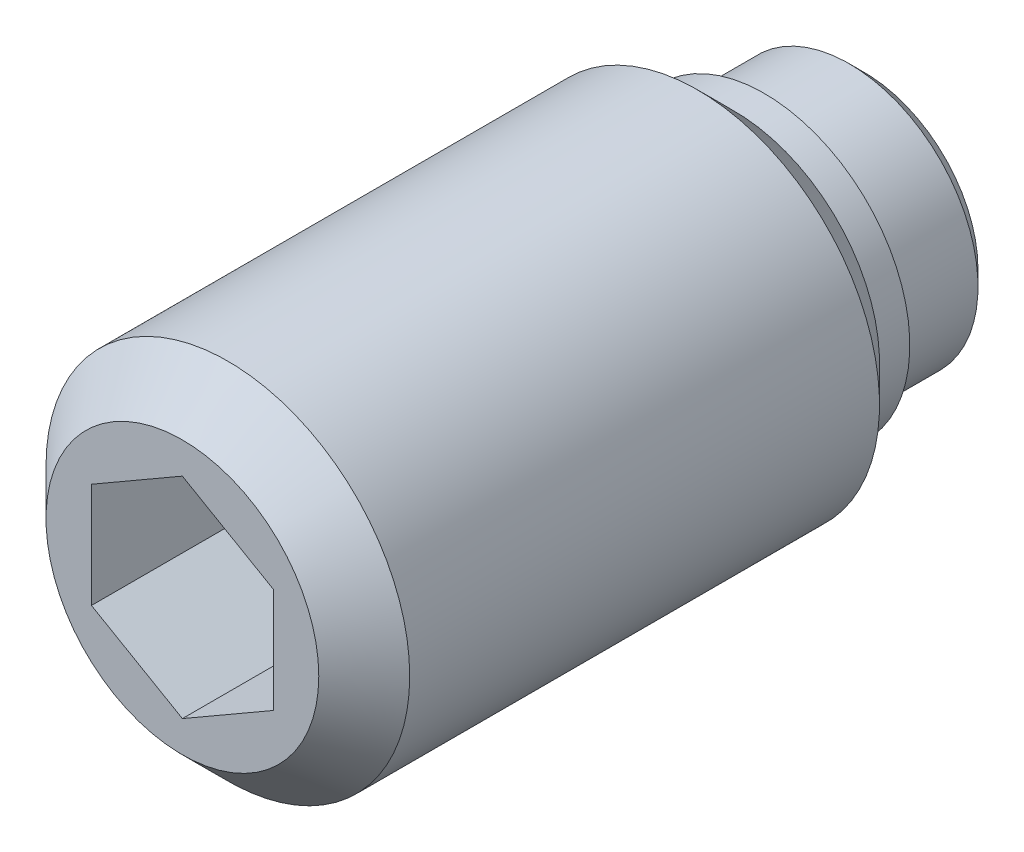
ISO-10303-21;
HEADER;
FILE_DESCRIPTION(('STEP AP214'),'2;1');
FILE_NAME('part.step','',(''),(''),'','','');
FILE_SCHEMA(('AUTOMOTIVE_DESIGN { 1 0 10303 214 1 1 1 1 }'));
ENDSEC;
DATA;
#1=APPLICATION_CONTEXT('core data for automotive mechanical design processes');
#2=APPLICATION_PROTOCOL_DEFINITION('international standard','automotive_design',2000,#1);
#3=PRODUCT_CONTEXT('',#1,'mechanical');
#4=PRODUCT('Part','Part','',(#3));
#5=PRODUCT_RELATED_PRODUCT_CATEGORY('part','',(#4));
#6=PRODUCT_DEFINITION_FORMATION('','',#4);
#7=PRODUCT_DEFINITION_CONTEXT('part definition',#1,'design');
#8=PRODUCT_DEFINITION('design','',#6,#7);
#9=PRODUCT_DEFINITION_SHAPE('','',#8);
#10=(LENGTH_UNIT() NAMED_UNIT(*) SI_UNIT(.MILLI.,.METRE.));
#11=(NAMED_UNIT(*) PLANE_ANGLE_UNIT() SI_UNIT($,.RADIAN.));
#12=(NAMED_UNIT(*) SI_UNIT($,.STERADIAN.) SOLID_ANGLE_UNIT());
#13=UNCERTAINTY_MEASURE_WITH_UNIT(LENGTH_MEASURE(1.E-05),#10,'distance_accuracy_value','');
#14=(GEOMETRIC_REPRESENTATION_CONTEXT(3) GLOBAL_UNCERTAINTY_ASSIGNED_CONTEXT((#13)) GLOBAL_UNIT_ASSIGNED_CONTEXT((#10,
#11,#12)) REPRESENTATION_CONTEXT('',''));
#15=CARTESIAN_POINT('',(0.,0.,0.));
#16=DIRECTION('',(0.,0.,1.));
#17=DIRECTION('',(1.,0.,0.));
#18=AXIS2_PLACEMENT_3D('',#15,#16,#17);
#19=CARTESIAN_POINT('',(0.,0.,3.3));
#20=DIRECTION('',(0.,0.,-1.));
#21=DIRECTION('',(-1.,0.,0.));
#22=AXIS2_PLACEMENT_3D('',#19,#20,#21);
#23=CYLINDRICAL_SURFACE('',#22,6.);
#24=CARTESIAN_POINT('',(0.,0.,5.5));
#25=DIRECTION('',(0.,0.,-1.));
#26=DIRECTION('',(-1.,0.,0.));
#27=AXIS2_PLACEMENT_3D('',#24,#25,#26);
#28=CIRCLE('',#27,6.);
#29=CARTESIAN_POINT('',(-6.,0.,5.5));
#30=VERTEX_POINT('',#29);
#31=EDGE_CURVE('E9',#30,#30,#28,.T.);
#32=ORIENTED_EDGE('',*,*,#31,.F.);
#33=EDGE_LOOP('',(#32));
#34=FACE_BOUND('',#33,.T.);
#35=CARTESIAN_POINT('',(0.,0.,21.));
#36=DIRECTION('',(0.,0.,1.));
#37=DIRECTION('',(1.,0.,0.));
#38=AXIS2_PLACEMENT_3D('',#35,#36,#37);
#39=CIRCLE('',#38,6.);
#40=CARTESIAN_POINT('',(6.,0.,21.));
#41=VERTEX_POINT('',#40);
#42=EDGE_CURVE('E123',#41,#41,#39,.T.);
#43=ORIENTED_EDGE('',*,*,#42,.F.);
#44=EDGE_LOOP('',(#43));
#45=FACE_BOUND('',#44,.T.);
#46=ADVANCED_FACE('F14',(#34,#45),#23,.T.);
#47=CARTESIAN_POINT('',(0.,0.,5.5));
#48=DIRECTION('',(0.,0.,1.));
#49=DIRECTION('',(1.,0.,0.));
#50=AXIS2_PLACEMENT_3D('',#47,#48,#49);
#51=CONICAL_SURFACE('',#50,6.,0.785398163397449);
#52=ORIENTED_EDGE('',*,*,#31,.T.);
#53=EDGE_LOOP('',(#52));
#54=FACE_BOUND('',#53,.T.);
#55=CARTESIAN_POINT('',(0.,0.,4.3));
#56=DIRECTION('',(0.,0.,-1.));
#57=DIRECTION('',(-1.,0.,0.));
#58=AXIS2_PLACEMENT_3D('',#55,#56,#57);
#59=CIRCLE('',#58,4.8);
#60=CARTESIAN_POINT('',(-4.8,0.,4.3));
#61=VERTEX_POINT('',#60);
#62=EDGE_CURVE('E21',#61,#61,#59,.T.);
#63=ORIENTED_EDGE('',*,*,#62,.F.);
#64=EDGE_LOOP('',(#63));
#65=FACE_BOUND('',#64,.T.);
#66=ADVANCED_FACE('F143',(#54,#65),#51,.T.);
#67=CARTESIAN_POINT('',(0.,0.,3.3));
#68=DIRECTION('',(0.,0.,-1.));
#69=DIRECTION('',(-1.,0.,0.));
#70=AXIS2_PLACEMENT_3D('',#67,#68,#69);
#71=CYLINDRICAL_SURFACE('',#70,4.8);
#72=ORIENTED_EDGE('',*,*,#62,.T.);
#73=EDGE_LOOP('',(#72));
#74=FACE_BOUND('',#73,.T.);
#75=CARTESIAN_POINT('',(0.,0.,3.3));
#76=DIRECTION('',(0.,0.,-1.));
#77=DIRECTION('',(-1.,0.,0.));
#78=AXIS2_PLACEMENT_3D('',#75,#76,#77);
#79=CIRCLE('',#78,4.8);
#80=CARTESIAN_POINT('',(-4.8,0.,3.3));
#81=VERTEX_POINT('',#80);
#82=EDGE_CURVE('E135',#81,#81,#79,.T.);
#83=ORIENTED_EDGE('',*,*,#82,.F.);
#84=EDGE_LOOP('',(#83));
#85=FACE_BOUND('',#84,.T.);
#86=ADVANCED_FACE('F140',(#74,#85),#71,.T.);
#87=CARTESIAN_POINT('',(0.,4.8,3.3));
#88=DIRECTION('',(0.,0.,1.));
#89=DIRECTION('',(1.,0.,0.));
#90=AXIS2_PLACEMENT_3D('',#87,#88,#89);
#91=PLANE('',#90);
#92=ORIENTED_EDGE('',*,*,#82,.T.);
#93=EDGE_LOOP('',(#92));
#94=FACE_BOUND('',#93,.T.);
#95=CARTESIAN_POINT('',(0.,0.,3.3));
#96=DIRECTION('',(0.,0.,-1.));
#97=DIRECTION('',(-1.,0.,0.));
#98=AXIS2_PLACEMENT_3D('',#95,#96,#97);
#99=CIRCLE('',#98,4.25);
#100=CARTESIAN_POINT('',(-4.25,0.,3.3));
#101=VERTEX_POINT('',#100);
#102=EDGE_CURVE('E132',#101,#101,#99,.T.);
#103=ORIENTED_EDGE('',*,*,#102,.F.);
#104=EDGE_LOOP('',(#103));
#105=FACE_BOUND('',#104,.T.);
#106=ADVANCED_FACE('F151',(#94,#105),#91,.F.);
#107=CARTESIAN_POINT('',(0.,0.,0.));
#108=DIRECTION('',(0.,0.,-1.));
#109=DIRECTION('',(-1.,0.,0.));
#110=AXIS2_PLACEMENT_3D('',#107,#108,#109);
#111=CYLINDRICAL_SURFACE('',#110,4.25);
#112=CARTESIAN_POINT('',(0.,0.,0.5));
#113=DIRECTION('',(0.,0.,-1.));
#114=DIRECTION('',(-1.,0.,0.));
#115=AXIS2_PLACEMENT_3D('',#112,#113,#114);
#116=CIRCLE('',#115,4.25);
#117=CARTESIAN_POINT('',(-4.25,0.,0.5));
#118=VERTEX_POINT('',#117);
#119=EDGE_CURVE('E129',#118,#118,#116,.T.);
#120=ORIENTED_EDGE('',*,*,#119,.F.);
#121=EDGE_LOOP('',(#120));
#122=FACE_BOUND('',#121,.T.);
#123=ORIENTED_EDGE('',*,*,#102,.T.);
#124=EDGE_LOOP('',(#123));
#125=FACE_BOUND('',#124,.T.);
#126=ADVANCED_FACE('F157',(#122,#125),#111,.T.);
#127=CARTESIAN_POINT('',(0.,0.,0.5));
#128=DIRECTION('',(0.,0.,1.));
#129=DIRECTION('',(1.,0.,0.));
#130=AXIS2_PLACEMENT_3D('',#127,#128,#129);
#131=CONICAL_SURFACE('',#130,4.25,0.785398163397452);
#132=CARTESIAN_POINT('',(0.,0.,0.));
#133=DIRECTION('',(0.,0.,-1.));
#134=DIRECTION('',(-1.,0.,0.));
#135=AXIS2_PLACEMENT_3D('',#132,#133,#134);
#136=CIRCLE('',#135,3.75);
#137=CARTESIAN_POINT('',(-3.75,0.,0.));
#138=VERTEX_POINT('',#137);
#139=EDGE_CURVE('E126',#138,#138,#136,.T.);
#140=ORIENTED_EDGE('',*,*,#139,.F.);
#141=EDGE_LOOP('',(#140));
#142=FACE_BOUND('',#141,.T.);
#143=ORIENTED_EDGE('',*,*,#119,.T.);
#144=EDGE_LOOP('',(#143));
#145=FACE_BOUND('',#144,.T.);
#146=ADVANCED_FACE('F161',(#142,#145),#131,.T.);
#147=CARTESIAN_POINT('',(0.,3.75,0.));
#148=DIRECTION('',(0.,0.,1.));
#149=DIRECTION('',(1.,0.,0.));
#150=AXIS2_PLACEMENT_3D('',#147,#148,#149);
#151=PLANE('',#150);
#152=ORIENTED_EDGE('',*,*,#139,.T.);
#153=EDGE_LOOP('',(#152));
#154=FACE_BOUND('',#153,.T.);
#155=ADVANCED_FACE('F165',(#154),#151,.F.);
#156=CARTESIAN_POINT('',(0.,0.,22.5));
#157=DIRECTION('',(0.,0.,-1.));
#158=DIRECTION('',(-1.,0.,0.));
#159=AXIS2_PLACEMENT_3D('',#156,#157,#158);
#160=CONICAL_SURFACE('',#159,4.5,0.785398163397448);
#161=ORIENTED_EDGE('',*,*,#42,.T.);
#162=EDGE_LOOP('',(#161));
#163=FACE_BOUND('',#162,.T.);
#164=CARTESIAN_POINT('',(0.,0.,22.5));
#165=DIRECTION('',(0.,0.,1.));
#166=DIRECTION('',(1.,0.,0.));
#167=AXIS2_PLACEMENT_3D('',#164,#165,#166);
#168=CIRCLE('',#167,4.5);
#169=CARTESIAN_POINT('',(4.5,0.,22.5));
#170=VERTEX_POINT('',#169);
#171=EDGE_CURVE('E115',#170,#170,#168,.T.);
#172=ORIENTED_EDGE('',*,*,#171,.F.);
#173=EDGE_LOOP('',(#172));
#174=FACE_BOUND('',#173,.T.);
#175=ADVANCED_FACE('F169',(#163,#174),#160,.T.);
#176=CARTESIAN_POINT('',(0.,-4.5,22.5));
#177=DIRECTION('',(0.,0.,1.));
#178=DIRECTION('',(1.,0.,0.));
#179=AXIS2_PLACEMENT_3D('',#176,#177,#178);
#180=PLANE('',#179);
#181=DIRECTION('',(0.866025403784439,-0.5,0.));
#182=VECTOR('',#181,1.);
#183=CARTESIAN_POINT('',(-3.,-1.73205080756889,22.5));
#184=LINE('',#183,#182);
#185=CARTESIAN_POINT('',(-3.,-1.73205080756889,22.5));
#186=VERTEX_POINT('',#185);
#187=CARTESIAN_POINT('',(0.,-3.46410161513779,22.5));
#188=VERTEX_POINT('',#187);
#189=EDGE_CURVE('E28',#186,#188,#184,.T.);
#190=ORIENTED_EDGE('',*,*,#189,.F.);
#191=DIRECTION('',(0.,-1.,0.));
#192=VECTOR('',#191,1.);
#193=CARTESIAN_POINT('',(-3.,1.73205080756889,22.5));
#194=LINE('',#193,#192);
#195=CARTESIAN_POINT('',(-3.,1.73205080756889,22.5));
#196=VERTEX_POINT('',#195);
#197=EDGE_CURVE('E111',#196,#186,#194,.T.);
#198=ORIENTED_EDGE('',*,*,#197,.F.);
#199=DIRECTION('',(-0.866025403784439,-0.5,0.));
#200=VECTOR('',#199,1.);
#201=CARTESIAN_POINT('',(0.,3.46410161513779,22.5));
#202=LINE('',#201,#200);
#203=CARTESIAN_POINT('',(0.,3.46410161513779,22.5));
#204=VERTEX_POINT('',#203);
#205=EDGE_CURVE('E109',#204,#196,#202,.T.);
#206=ORIENTED_EDGE('',*,*,#205,.F.);
#207=DIRECTION('',(-0.866025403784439,0.5,0.));
#208=VECTOR('',#207,1.);
#209=CARTESIAN_POINT('',(3.,1.73205080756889,22.5));
#210=LINE('',#209,#208);
#211=CARTESIAN_POINT('',(3.,1.73205080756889,22.5));
#212=VERTEX_POINT('',#211);
#213=EDGE_CURVE('E76',#212,#204,#210,.T.);
#214=ORIENTED_EDGE('',*,*,#213,.F.);
#215=DIRECTION('',(0.,1.,0.));
#216=VECTOR('',#215,1.);
#217=CARTESIAN_POINT('',(3.,-1.73205080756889,22.5));
#218=LINE('',#217,#216);
#219=CARTESIAN_POINT('',(3.,-1.73205080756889,22.5));
#220=VERTEX_POINT('',#219);
#221=EDGE_CURVE('E105',#220,#212,#218,.T.);
#222=ORIENTED_EDGE('',*,*,#221,.F.);
#223=DIRECTION('',(0.866025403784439,0.5,0.));
#224=VECTOR('',#223,1.);
#225=CARTESIAN_POINT('',(0.,-3.46410161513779,22.5));
#226=LINE('',#225,#224);
#227=EDGE_CURVE('E102',#188,#220,#226,.T.);
#228=ORIENTED_EDGE('',*,*,#227,.F.);
#229=EDGE_LOOP('',(#190,#198,#206,#214,#222,#228));
#230=FACE_BOUND('',#229,.T.);
#231=ORIENTED_EDGE('',*,*,#171,.T.);
#232=EDGE_LOOP('',(#231));
#233=FACE_BOUND('',#232,.T.);
#234=ADVANCED_FACE('F173',(#230,#233),#180,.T.);
#235=CARTESIAN_POINT('',(-3.,-1.73205080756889,14.5));
#236=DIRECTION('',(-0.5,-0.866025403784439,0.));
#237=DIRECTION('',(0.866025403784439,-0.5,0.));
#238=AXIS2_PLACEMENT_3D('',#235,#236,#237);
#239=PLANE('',#238);
#240=ORIENTED_EDGE('',*,*,#189,.T.);
#241=DIRECTION('',(0.,0.,1.));
#242=VECTOR('',#241,1.);
#243=CARTESIAN_POINT('',(0.,-3.46410161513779,14.5));
#244=LINE('',#243,#242);
#245=CARTESIAN_POINT('',(0.,-3.46410161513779,14.5));
#246=VERTEX_POINT('',#245);
#247=EDGE_CURVE('E58',#246,#188,#244,.T.);
#248=ORIENTED_EDGE('',*,*,#247,.F.);
#249=DIRECTION('',(0.866025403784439,-0.5,0.));
#250=VECTOR('',#249,1.);
#251=CARTESIAN_POINT('',(-3.,-1.73205080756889,14.5));
#252=LINE('',#251,#250);
#253=CARTESIAN_POINT('',(-3.,-1.73205080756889,14.5));
#254=VERTEX_POINT('',#253);
#255=EDGE_CURVE('E113',#254,#246,#252,.T.);
#256=ORIENTED_EDGE('',*,*,#255,.F.);
#257=DIRECTION('',(0.,0.,1.));
#258=VECTOR('',#257,1.);
#259=CARTESIAN_POINT('',(-3.,-1.73205080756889,14.5));
#260=LINE('',#259,#258);
#261=EDGE_CURVE('E36',#254,#186,#260,.T.);
#262=ORIENTED_EDGE('',*,*,#261,.T.);
#263=EDGE_LOOP('',(#240,#248,#256,#262));
#264=FACE_BOUND('',#263,.T.);
#265=ADVANCED_FACE('F177',(#264),#239,.F.);
#266=CARTESIAN_POINT('',(-3.,1.73205080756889,14.5));
#267=DIRECTION('',(-1.,0.,0.));
#268=DIRECTION('',(0.,0.,1.));
#269=AXIS2_PLACEMENT_3D('',#266,#267,#268);
#270=PLANE('',#269);
#271=ORIENTED_EDGE('',*,*,#197,.T.);
#272=ORIENTED_EDGE('',*,*,#261,.F.);
#273=DIRECTION('',(0.,-1.,0.));
#274=VECTOR('',#273,1.);
#275=CARTESIAN_POINT('',(-3.,1.73205080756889,14.5));
#276=LINE('',#275,#274);
#277=CARTESIAN_POINT('',(-3.,1.73205080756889,14.5));
#278=VERTEX_POINT('',#277);
#279=EDGE_CURVE('E88',#278,#254,#276,.T.);
#280=ORIENTED_EDGE('',*,*,#279,.F.);
#281=DIRECTION('',(0.,0.,1.));
#282=VECTOR('',#281,1.);
#283=CARTESIAN_POINT('',(-3.,1.73205080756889,14.5));
#284=LINE('',#283,#282);
#285=EDGE_CURVE('E80',#278,#196,#284,.T.);
#286=ORIENTED_EDGE('',*,*,#285,.T.);
#287=EDGE_LOOP('',(#271,#272,#280,#286));
#288=FACE_BOUND('',#287,.T.);
#289=ADVANCED_FACE('F181',(#288),#270,.F.);
#290=CARTESIAN_POINT('',(0.,3.46410161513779,14.5));
#291=DIRECTION('',(-0.5,0.866025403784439,0.));
#292=DIRECTION('',(-0.866025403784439,-0.5,0.));
#293=AXIS2_PLACEMENT_3D('',#290,#291,#292);
#294=PLANE('',#293);
#295=ORIENTED_EDGE('',*,*,#205,.T.);
#296=ORIENTED_EDGE('',*,*,#285,.F.);
#297=DIRECTION('',(-0.866025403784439,-0.5,0.));
#298=VECTOR('',#297,1.);
#299=CARTESIAN_POINT('',(0.,3.46410161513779,14.5));
#300=LINE('',#299,#298);
#301=CARTESIAN_POINT('',(0.,3.46410161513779,14.5));
#302=VERTEX_POINT('',#301);
#303=EDGE_CURVE('E84',#302,#278,#300,.T.);
#304=ORIENTED_EDGE('',*,*,#303,.F.);
#305=DIRECTION('',(0.,0.,1.));
#306=VECTOR('',#305,1.);
#307=CARTESIAN_POINT('',(0.,3.46410161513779,14.5));
#308=LINE('',#307,#306);
#309=EDGE_CURVE('E69',#302,#204,#308,.T.);
#310=ORIENTED_EDGE('',*,*,#309,.T.);
#311=EDGE_LOOP('',(#295,#296,#304,#310));
#312=FACE_BOUND('',#311,.T.);
#313=ADVANCED_FACE('F85',(#312),#294,.F.);
#314=CARTESIAN_POINT('',(3.,1.73205080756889,14.5));
#315=DIRECTION('',(0.5,0.866025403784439,0.));
#316=DIRECTION('',(-0.866025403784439,0.5,0.));
#317=AXIS2_PLACEMENT_3D('',#314,#315,#316);
#318=PLANE('',#317);
#319=ORIENTED_EDGE('',*,*,#213,.T.);
#320=ORIENTED_EDGE('',*,*,#309,.F.);
#321=DIRECTION('',(-0.866025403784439,0.5,0.));
#322=VECTOR('',#321,1.);
#323=CARTESIAN_POINT('',(3.,1.73205080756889,14.5));
#324=LINE('',#323,#322);
#325=CARTESIAN_POINT('',(3.,1.73205080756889,14.5));
#326=VERTEX_POINT('',#325);
#327=EDGE_CURVE('E73',#326,#302,#324,.T.);
#328=ORIENTED_EDGE('',*,*,#327,.F.);
#329=DIRECTION('',(0.,0.,1.));
#330=VECTOR('',#329,1.);
#331=CARTESIAN_POINT('',(3.,1.73205080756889,14.5));
#332=LINE('',#331,#330);
#333=EDGE_CURVE('E81',#326,#212,#332,.T.);
#334=ORIENTED_EDGE('',*,*,#333,.T.);
#335=EDGE_LOOP('',(#319,#320,#328,#334));
#336=FACE_BOUND('',#335,.T.);
#337=ADVANCED_FACE('F71',(#336),#318,.F.);
#338=CARTESIAN_POINT('',(3.,-1.73205080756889,14.5));
#339=DIRECTION('',(1.,0.,0.));
#340=DIRECTION('',(0.,0.,-1.));
#341=AXIS2_PLACEMENT_3D('',#338,#339,#340);
#342=PLANE('',#341);
#343=ORIENTED_EDGE('',*,*,#221,.T.);
#344=ORIENTED_EDGE('',*,*,#333,.F.);
#345=DIRECTION('',(0.,1.,0.));
#346=VECTOR('',#345,1.);
#347=CARTESIAN_POINT('',(3.,-1.73205080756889,14.5));
#348=LINE('',#347,#346);
#349=CARTESIAN_POINT('',(3.,-1.73205080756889,14.5));
#350=VERTEX_POINT('',#349);
#351=EDGE_CURVE('E94',#350,#326,#348,.T.);
#352=ORIENTED_EDGE('',*,*,#351,.F.);
#353=DIRECTION('',(0.,0.,1.));
#354=VECTOR('',#353,1.);
#355=CARTESIAN_POINT('',(3.,-1.73205080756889,14.5));
#356=LINE('',#355,#354);
#357=EDGE_CURVE('E118',#350,#220,#356,.T.);
#358=ORIENTED_EDGE('',*,*,#357,.T.);
#359=EDGE_LOOP('',(#343,#344,#352,#358));
#360=FACE_BOUND('',#359,.T.);
#361=ADVANCED_FACE('F185',(#360),#342,.F.);
#362=CARTESIAN_POINT('',(0.,-3.46410161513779,14.5));
#363=DIRECTION('',(0.5,-0.866025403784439,0.));
#364=DIRECTION('',(0.866025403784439,0.5,0.));
#365=AXIS2_PLACEMENT_3D('',#362,#363,#364);
#366=PLANE('',#365);
#367=ORIENTED_EDGE('',*,*,#227,.T.);
#368=ORIENTED_EDGE('',*,*,#357,.F.);
#369=DIRECTION('',(0.866025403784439,0.5,0.));
#370=VECTOR('',#369,1.);
#371=CARTESIAN_POINT('',(0.,-3.46410161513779,14.5));
#372=LINE('',#371,#370);
#373=EDGE_CURVE('E96',#246,#350,#372,.T.);
#374=ORIENTED_EDGE('',*,*,#373,.F.);
#375=ORIENTED_EDGE('',*,*,#247,.T.);
#376=EDGE_LOOP('',(#367,#368,#374,#375));
#377=FACE_BOUND('',#376,.T.);
#378=ADVANCED_FACE('F182',(#377),#366,.F.);
#379=CARTESIAN_POINT('',(0.,0.,14.5));
#380=DIRECTION('',(0.,0.,1.));
#381=DIRECTION('',(1.,0.,0.));
#382=AXIS2_PLACEMENT_3D('',#379,#380,#381);
#383=PLANE('',#382);
#384=ORIENTED_EDGE('',*,*,#255,.T.);
#385=ORIENTED_EDGE('',*,*,#373,.T.);
#386=ORIENTED_EDGE('',*,*,#351,.T.);
#387=ORIENTED_EDGE('',*,*,#327,.T.);
#388=ORIENTED_EDGE('',*,*,#303,.T.);
#389=ORIENTED_EDGE('',*,*,#279,.T.);
#390=EDGE_LOOP('',(#384,#385,#386,#387,#388,#389));
#391=FACE_BOUND('',#390,.T.);
#392=ADVANCED_FACE('F91',(#391),#383,.T.);
#393=CLOSED_SHELL('',(#46,#66,#86,#106,#126,#146,#155,#175,#234,#265,#289,#313,#337,#361,#378,#392));
#394=MANIFOLD_SOLID_BREP('B1',#393);
#395=ADVANCED_BREP_SHAPE_REPRESENTATION('',(#18,#394),#14);
#396=SHAPE_DEFINITION_REPRESENTATION(#9,#395);
ENDSEC;
END-ISO-10303-21;
